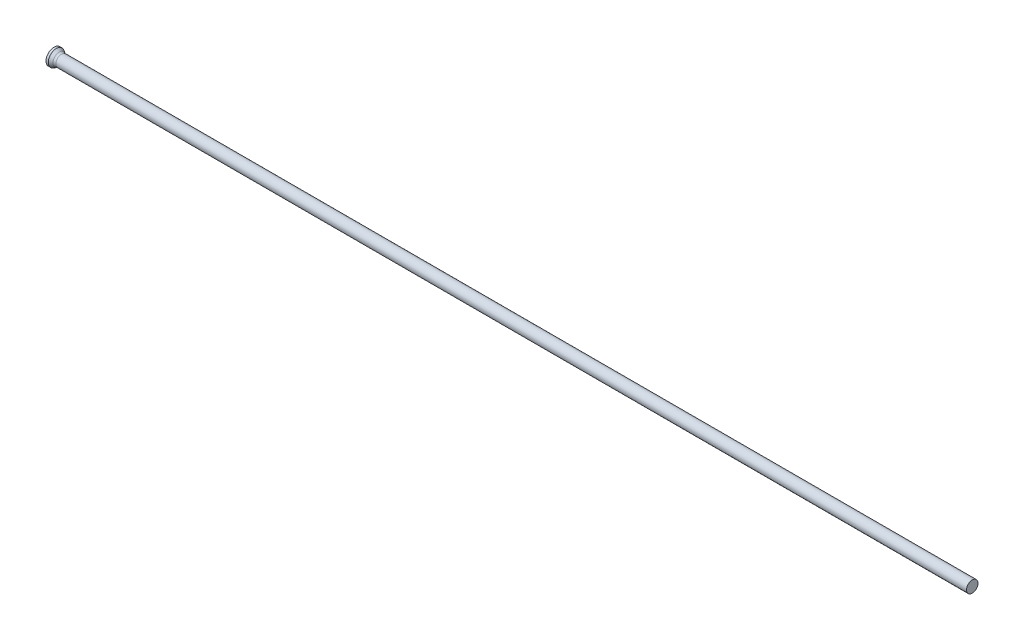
ISO-10303-21;
HEADER;
FILE_DESCRIPTION(('STEP AP214'),'2;1');
FILE_NAME('part.step','',(''),(''),'','','');
FILE_SCHEMA(('AUTOMOTIVE_DESIGN { 1 0 10303 214 1 1 1 1 }'));
ENDSEC;
DATA;
#1=APPLICATION_CONTEXT('core data for automotive mechanical design processes');
#2=APPLICATION_PROTOCOL_DEFINITION('international standard','automotive_design',2000,#1);
#3=PRODUCT_CONTEXT('',#1,'mechanical');
#4=PRODUCT('Part','Part','',(#3));
#5=PRODUCT_RELATED_PRODUCT_CATEGORY('part','',(#4));
#6=PRODUCT_DEFINITION_FORMATION('','',#4);
#7=PRODUCT_DEFINITION_CONTEXT('part definition',#1,'design');
#8=PRODUCT_DEFINITION('design','',#6,#7);
#9=PRODUCT_DEFINITION_SHAPE('','',#8);
#10=(LENGTH_UNIT() NAMED_UNIT(*) SI_UNIT(.MILLI.,.METRE.));
#11=(NAMED_UNIT(*) PLANE_ANGLE_UNIT() SI_UNIT($,.RADIAN.));
#12=(NAMED_UNIT(*) SI_UNIT($,.STERADIAN.) SOLID_ANGLE_UNIT());
#13=UNCERTAINTY_MEASURE_WITH_UNIT(LENGTH_MEASURE(1.E-05),#10,'distance_accuracy_value','');
#14=(GEOMETRIC_REPRESENTATION_CONTEXT(3) GLOBAL_UNCERTAINTY_ASSIGNED_CONTEXT((#13)) GLOBAL_UNIT_ASSIGNED_CONTEXT((#10,
#11,#12)) REPRESENTATION_CONTEXT('',''));
#15=CARTESIAN_POINT('',(0.,0.,0.));
#16=DIRECTION('',(0.,0.,1.));
#17=DIRECTION('',(1.,0.,0.));
#18=AXIS2_PLACEMENT_3D('',#15,#16,#17);
#19=CARTESIAN_POINT('',(0.,0.,0.));
#20=DIRECTION('',(1.,0.,0.));
#21=DIRECTION('',(0.,0.,-1.));
#22=AXIS2_PLACEMENT_3D('',#19,#20,#21);
#23=PLANE('',#22);
#24=CARTESIAN_POINT('',(0.,0.,0.));
#25=DIRECTION('',(-1.,0.,0.));
#26=DIRECTION('',(0.,0.,1.));
#27=AXIS2_PLACEMENT_3D('',#24,#25,#26);
#28=CIRCLE('',#27,1.75);
#29=CARTESIAN_POINT('',(0.,0.,1.75));
#30=VERTEX_POINT('',#29);
#31=EDGE_CURVE('E25',#30,#30,#28,.T.);
#32=ORIENTED_EDGE('',*,*,#31,.T.);
#33=EDGE_LOOP('',(#32));
#34=FACE_BOUND('',#33,.T.);
#35=ADVANCED_FACE('F14',(#34),#23,.F.);
#36=CARTESIAN_POINT('',(0.,0.,0.));
#37=DIRECTION('',(-1.,0.,0.));
#38=DIRECTION('',(0.,0.,1.));
#39=AXIS2_PLACEMENT_3D('',#36,#37,#38);
#40=CYLINDRICAL_SURFACE('',#39,1.75);
#41=ORIENTED_EDGE('',*,*,#31,.F.);
#42=EDGE_LOOP('',(#41));
#43=FACE_BOUND('',#42,.T.);
#44=CARTESIAN_POINT('',(0.503974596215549,0.,0.));
#45=DIRECTION('',(-1.,0.,0.));
#46=DIRECTION('',(0.,0.,1.));
#47=AXIS2_PLACEMENT_3D('',#44,#45,#46);
#48=CIRCLE('',#47,1.75);
#49=CARTESIAN_POINT('',(0.503974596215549,0.,1.75));
#50=VERTEX_POINT('',#49);
#51=EDGE_CURVE('E29',#50,#50,#48,.T.);
#52=ORIENTED_EDGE('',*,*,#51,.T.);
#53=EDGE_LOOP('',(#52));
#54=FACE_BOUND('',#53,.T.);
#55=ADVANCED_FACE('F53',(#43,#54),#40,.T.);
#56=CARTESIAN_POINT('',(1.37,0.,0.));
#57=DIRECTION('',(-1.,0.,0.));
#58=DIRECTION('',(0.,0.,1.));
#59=AXIS2_PLACEMENT_3D('',#56,#57,#58);
#60=CONICAL_SURFACE('',#59,1.25,0.523598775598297);
#61=CARTESIAN_POINT('',(1.13794919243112,0.,0.));
#62=DIRECTION('',(-1.,0.,0.));
#63=DIRECTION('',(0.,0.,1.));
#64=AXIS2_PLACEMENT_3D('',#61,#62,#63);
#65=CIRCLE('',#64,1.38397459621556);
#66=CARTESIAN_POINT('',(1.13794919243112,0.,1.38397459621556));
#67=VERTEX_POINT('',#66);
#68=EDGE_CURVE('E21',#67,#67,#65,.T.);
#69=ORIENTED_EDGE('',*,*,#68,.T.);
#70=EDGE_LOOP('',(#69));
#71=FACE_BOUND('',#70,.T.);
#72=ORIENTED_EDGE('',*,*,#51,.F.);
#73=EDGE_LOOP('',(#72));
#74=FACE_BOUND('',#73,.T.);
#75=ADVANCED_FACE('F50',(#71,#74),#60,.T.);
#76=CARTESIAN_POINT('',(0.,0.,0.));
#77=DIRECTION('',(-1.,0.,0.));
#78=DIRECTION('',(0.,0.,1.));
#79=AXIS2_PLACEMENT_3D('',#76,#77,#78);
#80=CYLINDRICAL_SURFACE('',#79,1.25);
#81=CARTESIAN_POINT('',(1.63794919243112,0.,0.));
#82=DIRECTION('',(-1.,0.,0.));
#83=DIRECTION('',(0.,0.,1.));
#84=AXIS2_PLACEMENT_3D('',#81,#82,#83);
#85=CIRCLE('',#84,1.25);
#86=CARTESIAN_POINT('',(1.63794919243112,0.,1.25));
#87=VERTEX_POINT('',#86);
#88=EDGE_CURVE('E9',#87,#87,#85,.F.);
#89=ORIENTED_EDGE('',*,*,#88,.T.);
#90=EDGE_LOOP('',(#89));
#91=FACE_BOUND('',#90,.T.);
#92=CARTESIAN_POINT('',(200.,0.,0.));
#93=DIRECTION('',(-1.,0.,0.));
#94=DIRECTION('',(0.,0.,1.));
#95=AXIS2_PLACEMENT_3D('',#92,#93,#94);
#96=CIRCLE('',#95,1.25);
#97=CARTESIAN_POINT('',(200.,0.,1.25));
#98=VERTEX_POINT('',#97);
#99=EDGE_CURVE('E34',#98,#98,#96,.T.);
#100=ORIENTED_EDGE('',*,*,#99,.T.);
#101=EDGE_LOOP('',(#100));
#102=FACE_BOUND('',#101,.T.);
#103=ADVANCED_FACE('F38',(#91,#102),#80,.T.);
#104=CARTESIAN_POINT('',(200.,1.25,0.));
#105=DIRECTION('',(-1.,0.,0.));
#106=DIRECTION('',(0.,0.,1.));
#107=AXIS2_PLACEMENT_3D('',#104,#105,#106);
#108=PLANE('',#107);
#109=ORIENTED_EDGE('',*,*,#99,.F.);
#110=EDGE_LOOP('',(#109));
#111=FACE_BOUND('',#110,.T.);
#112=ADVANCED_FACE('F40',(#111),#108,.F.);
#113=CARTESIAN_POINT('',(1.63794919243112,0.,0.));
#114=DIRECTION('',(-1.,0.,0.));
#115=DIRECTION('',(0.,0.,1.));
#116=AXIS2_PLACEMENT_3D('',#113,#114,#115);
#117=TOROIDAL_SURFACE('',#116,2.25,1.);
#118=ORIENTED_EDGE('',*,*,#88,.F.);
#119=EDGE_LOOP('',(#118));
#120=FACE_BOUND('',#119,.T.);
#121=ORIENTED_EDGE('',*,*,#68,.F.);
#122=EDGE_LOOP('',(#121));
#123=FACE_BOUND('',#122,.T.);
#124=ADVANCED_FACE('F16',(#120,#123),#117,.F.);
#125=CLOSED_SHELL('',(#35,#55,#75,#103,#112,#124));
#126=MANIFOLD_SOLID_BREP('B1',#125);
#127=ADVANCED_BREP_SHAPE_REPRESENTATION('',(#18,#126),#14);
#128=SHAPE_DEFINITION_REPRESENTATION(#9,#127);
ENDSEC;
END-ISO-10303-21;
